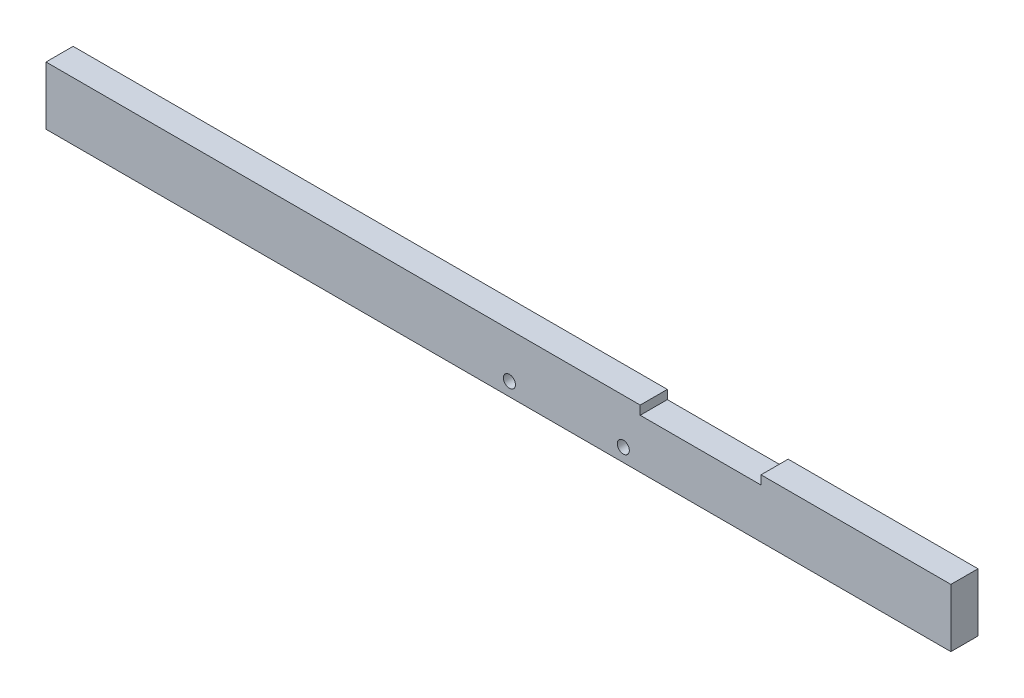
from build123d import *

# Parameters (mm, degrees)
SKETCH_1_R      = 2.25
EXTRUDE_1_DEPTH = 10.1


with BuildPart() as part:
    # Sketch 1 → Extrude 1 (new body)
    with BuildSketch(Plane.XY):
        Polygon((0, 0), (0, 21.7), (221.3, 21.7), (221.3, 18.4), (266.3, 18.4), (266.3, 21.7), (337, 21.7), (337, 0), align=None)
        with Locations((215, 5)):
            Circle(SKETCH_1_R, mode=Mode.SUBTRACT)
        with Locations((172.6, 5)):
            Circle(SKETCH_1_R, mode=Mode.SUBTRACT)
    extrude(amount=EXTRUDE_1_DEPTH)


solid = part.part
